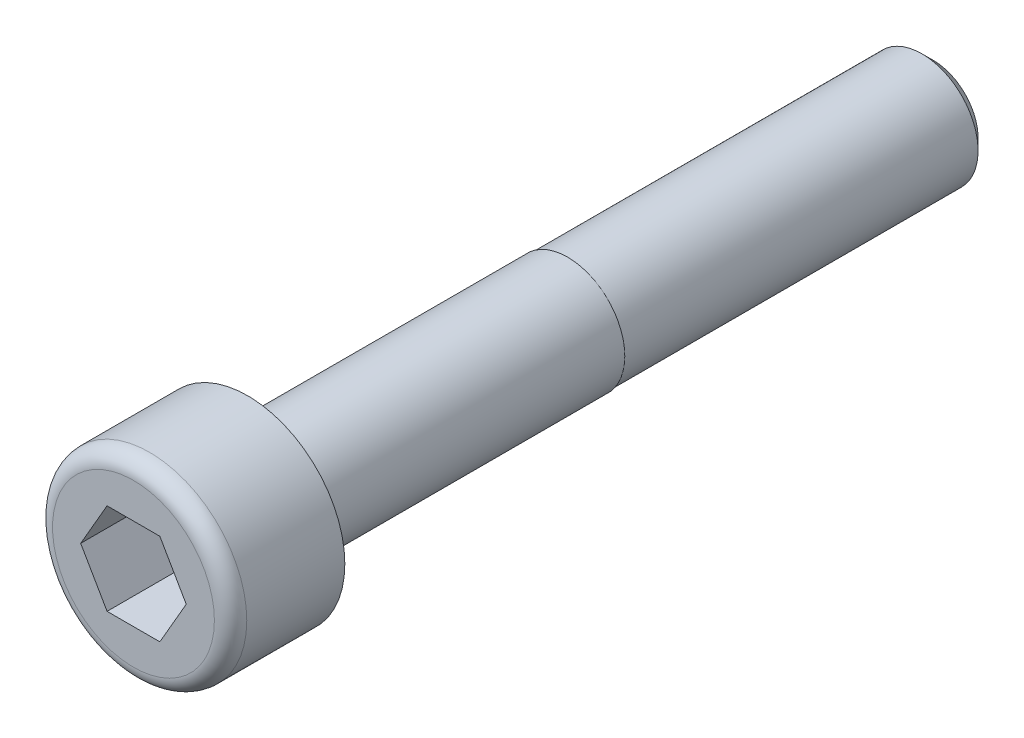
ISO-10303-21;
HEADER;
FILE_DESCRIPTION(('STEP AP214'),'2;1');
FILE_NAME('part.step','',(''),(''),'','','');
FILE_SCHEMA(('AUTOMOTIVE_DESIGN { 1 0 10303 214 1 1 1 1 }'));
ENDSEC;
DATA;
#1=APPLICATION_CONTEXT('core data for automotive mechanical design processes');
#2=APPLICATION_PROTOCOL_DEFINITION('international standard','automotive_design',2000,#1);
#3=PRODUCT_CONTEXT('',#1,'mechanical');
#4=PRODUCT('Part','Part','',(#3));
#5=PRODUCT_RELATED_PRODUCT_CATEGORY('part','',(#4));
#6=PRODUCT_DEFINITION_FORMATION('','',#4);
#7=PRODUCT_DEFINITION_CONTEXT('part definition',#1,'design');
#8=PRODUCT_DEFINITION('design','',#6,#7);
#9=PRODUCT_DEFINITION_SHAPE('','',#8);
#10=(LENGTH_UNIT() NAMED_UNIT(*) SI_UNIT(.MILLI.,.METRE.));
#11=(NAMED_UNIT(*) PLANE_ANGLE_UNIT() SI_UNIT($,.RADIAN.));
#12=(NAMED_UNIT(*) SI_UNIT($,.STERADIAN.) SOLID_ANGLE_UNIT());
#13=UNCERTAINTY_MEASURE_WITH_UNIT(LENGTH_MEASURE(1.E-05),#10,'distance_accuracy_value','');
#14=(GEOMETRIC_REPRESENTATION_CONTEXT(3) GLOBAL_UNCERTAINTY_ASSIGNED_CONTEXT((#13)) GLOBAL_UNIT_ASSIGNED_CONTEXT((#10,
#11,#12)) REPRESENTATION_CONTEXT('',''));
#15=CARTESIAN_POINT('',(0.,0.,0.));
#16=DIRECTION('',(0.,0.,1.));
#17=DIRECTION('',(1.,0.,0.));
#18=AXIS2_PLACEMENT_3D('',#15,#16,#17);
#19=CARTESIAN_POINT('',(0.,0.,-14.));
#20=DIRECTION('',(0.,0.,-1.));
#21=DIRECTION('',(-1.,0.,0.));
#22=AXIS2_PLACEMENT_3D('',#19,#20,#21);
#23=PLANE('',#22);
#24=CARTESIAN_POINT('',(0.,0.,-14.));
#25=DIRECTION('',(0.,0.,-1.));
#26=DIRECTION('',(-1.,0.,0.));
#27=AXIS2_PLACEMENT_3D('',#24,#25,#26);
#28=CIRCLE('',#27,2.5);
#29=CARTESIAN_POINT('',(-2.5,0.,-14.));
#30=VERTEX_POINT('',#29);
#31=EDGE_CURVE('E136',#30,#30,#28,.T.);
#32=ORIENTED_EDGE('',*,*,#31,.T.);
#33=EDGE_LOOP('',(#32));
#34=FACE_BOUND('',#33,.T.);
#35=CARTESIAN_POINT('',(0.,0.,-14.));
#36=DIRECTION('',(0.,0.,-1.));
#37=DIRECTION('',(-1.,0.,0.));
#38=AXIS2_PLACEMENT_3D('',#35,#36,#37);
#39=CIRCLE('',#38,2.45);
#40=CARTESIAN_POINT('',(-2.45,0.,-14.));
#41=VERTEX_POINT('',#40);
#42=EDGE_CURVE('E123',#41,#41,#39,.T.);
#43=ORIENTED_EDGE('',*,*,#42,.F.);
#44=EDGE_LOOP('',(#43));
#45=FACE_BOUND('',#44,.T.);
#46=ADVANCED_FACE('F33',(#34,#45),#23,.T.);
#47=CARTESIAN_POINT('',(0.,0.,0.));
#48=DIRECTION('',(0.,0.,1.));
#49=DIRECTION('',(1.,0.,0.));
#50=AXIS2_PLACEMENT_3D('',#47,#48,#49);
#51=PLANE('',#50);
#52=CARTESIAN_POINT('',(0.,0.,0.));
#53=DIRECTION('',(0.,0.,1.));
#54=DIRECTION('',(1.,0.,0.));
#55=AXIS2_PLACEMENT_3D('',#52,#53,#54);
#56=CIRCLE('',#55,4.25);
#57=CARTESIAN_POINT('',(4.25,0.,0.));
#58=VERTEX_POINT('',#57);
#59=EDGE_CURVE('E144',#58,#58,#56,.T.);
#60=ORIENTED_EDGE('',*,*,#59,.F.);
#61=EDGE_LOOP('',(#60));
#62=FACE_BOUND('',#61,.T.);
#63=CARTESIAN_POINT('',(0.,0.,0.));
#64=DIRECTION('',(0.,0.,1.));
#65=DIRECTION('',(1.,0.,0.));
#66=AXIS2_PLACEMENT_3D('',#63,#64,#65);
#67=CIRCLE('',#66,2.5);
#68=CARTESIAN_POINT('',(2.5,0.,0.));
#69=VERTEX_POINT('',#68);
#70=EDGE_CURVE('E147',#69,#69,#67,.F.);
#71=ORIENTED_EDGE('',*,*,#70,.F.);
#72=EDGE_LOOP('',(#71));
#73=FACE_BOUND('',#72,.T.);
#74=ADVANCED_FACE('F171',(#62,#73),#51,.F.);
#75=CARTESIAN_POINT('',(0.,0.,5.));
#76=DIRECTION('',(0.,0.,-1.));
#77=DIRECTION('',(-1.,0.,0.));
#78=AXIS2_PLACEMENT_3D('',#75,#76,#77);
#79=CYLINDRICAL_SURFACE('',#78,4.25);
#80=CARTESIAN_POINT('',(0.,0.,4.29166666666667));
#81=DIRECTION('',(0.,0.,1.));
#82=DIRECTION('',(1.,0.,0.));
#83=AXIS2_PLACEMENT_3D('',#80,#81,#82);
#84=CIRCLE('',#83,4.25);
#85=CARTESIAN_POINT('',(4.25,0.,4.29166666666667));
#86=VERTEX_POINT('',#85);
#87=EDGE_CURVE('E11',#86,#86,#84,.F.);
#88=ORIENTED_EDGE('',*,*,#87,.T.);
#89=EDGE_LOOP('',(#88));
#90=FACE_BOUND('',#89,.T.);
#91=ORIENTED_EDGE('',*,*,#59,.T.);
#92=EDGE_LOOP('',(#91));
#93=FACE_BOUND('',#92,.T.);
#94=ADVANCED_FACE('F177',(#90,#93),#79,.T.);
#95=CARTESIAN_POINT('',(0.,0.,5.));
#96=DIRECTION('',(0.,0.,1.));
#97=DIRECTION('',(1.,0.,0.));
#98=AXIS2_PLACEMENT_3D('',#95,#96,#97);
#99=PLANE('',#98);
#100=CARTESIAN_POINT('',(0.,0.,5.));
#101=DIRECTION('',(0.,0.,1.));
#102=DIRECTION('',(1.,0.,0.));
#103=AXIS2_PLACEMENT_3D('',#100,#101,#102);
#104=CIRCLE('',#103,3.54166666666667);
#105=CARTESIAN_POINT('',(3.54166666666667,0.,5.));
#106=VERTEX_POINT('',#105);
#107=EDGE_CURVE('E41',#106,#106,#104,.T.);
#108=ORIENTED_EDGE('',*,*,#107,.T.);
#109=EDGE_LOOP('',(#108));
#110=FACE_BOUND('',#109,.T.);
#111=DIRECTION('',(0.500000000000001,0.866025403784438,0.));
#112=VECTOR('',#111,1.);
#113=CARTESIAN_POINT('',(1.15470053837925,-2.,5.));
#114=LINE('',#113,#112);
#115=CARTESIAN_POINT('',(1.15470053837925,-2.,5.));
#116=VERTEX_POINT('',#115);
#117=CARTESIAN_POINT('',(2.3094010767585,0.,5.));
#118=VERTEX_POINT('',#117);
#119=EDGE_CURVE('E48',#116,#118,#114,.T.);
#120=ORIENTED_EDGE('',*,*,#119,.F.);
#121=DIRECTION('',(1.,0.,0.));
#122=VECTOR('',#121,1.);
#123=CARTESIAN_POINT('',(-1.15470053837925,-2.,5.));
#124=LINE('',#123,#122);
#125=CARTESIAN_POINT('',(-1.15470053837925,-2.,5.));
#126=VERTEX_POINT('',#125);
#127=EDGE_CURVE('E132',#126,#116,#124,.T.);
#128=ORIENTED_EDGE('',*,*,#127,.F.);
#129=DIRECTION('',(0.500000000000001,-0.866025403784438,0.));
#130=VECTOR('',#129,1.);
#131=CARTESIAN_POINT('',(-2.3094010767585,0.,5.));
#132=LINE('',#131,#130);
#133=CARTESIAN_POINT('',(-2.3094010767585,0.,5.));
#134=VERTEX_POINT('',#133);
#135=EDGE_CURVE('E130',#134,#126,#132,.T.);
#136=ORIENTED_EDGE('',*,*,#135,.F.);
#137=DIRECTION('',(-0.500000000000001,-0.866025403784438,0.));
#138=VECTOR('',#137,1.);
#139=CARTESIAN_POINT('',(-1.15470053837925,2.,5.));
#140=LINE('',#139,#138);
#141=CARTESIAN_POINT('',(-1.15470053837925,2.,5.));
#142=VERTEX_POINT('',#141);
#143=EDGE_CURVE('E96',#142,#134,#140,.T.);
#144=ORIENTED_EDGE('',*,*,#143,.F.);
#145=DIRECTION('',(-1.,0.,0.));
#146=VECTOR('',#145,1.);
#147=CARTESIAN_POINT('',(1.15470053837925,2.,5.));
#148=LINE('',#147,#146);
#149=CARTESIAN_POINT('',(1.15470053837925,2.,5.));
#150=VERTEX_POINT('',#149);
#151=EDGE_CURVE('E126',#150,#142,#148,.T.);
#152=ORIENTED_EDGE('',*,*,#151,.F.);
#153=DIRECTION('',(-0.500000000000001,0.866025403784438,0.));
#154=VECTOR('',#153,1.);
#155=CARTESIAN_POINT('',(2.3094010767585,0.,5.));
#156=LINE('',#155,#154);
#157=EDGE_CURVE('E122',#118,#150,#156,.T.);
#158=ORIENTED_EDGE('',*,*,#157,.F.);
#159=EDGE_LOOP('',(#120,#128,#136,#144,#152,#158));
#160=FACE_BOUND('',#159,.T.);
#161=ADVANCED_FACE('F158',(#110,#160),#99,.T.);
#162=CARTESIAN_POINT('',(0.,0.,-14.));
#163=DIRECTION('',(0.,0.,1.));
#164=DIRECTION('',(1.,0.,0.));
#165=AXIS2_PLACEMENT_3D('',#162,#163,#164);
#166=CYLINDRICAL_SURFACE('',#165,2.5);
#167=ORIENTED_EDGE('',*,*,#31,.F.);
#168=EDGE_LOOP('',(#167));
#169=FACE_BOUND('',#168,.T.);
#170=ORIENTED_EDGE('',*,*,#70,.T.);
#171=EDGE_LOOP('',(#170));
#172=FACE_BOUND('',#171,.T.);
#173=ADVANCED_FACE('F185',(#169,#172),#166,.T.);
#174=CARTESIAN_POINT('',(1.15470053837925,-2.,0.));
#175=DIRECTION('',(0.866025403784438,-0.500000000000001,0.));
#176=DIRECTION('',(0.500000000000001,0.866025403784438,0.));
#177=AXIS2_PLACEMENT_3D('',#174,#175,#176);
#178=PLANE('',#177);
#179=ORIENTED_EDGE('',*,*,#119,.T.);
#180=DIRECTION('',(0.,0.,1.));
#181=VECTOR('',#180,1.);
#182=CARTESIAN_POINT('',(2.3094010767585,0.,0.));
#183=LINE('',#182,#181);
#184=CARTESIAN_POINT('',(2.3094010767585,0.,0.));
#185=VERTEX_POINT('',#184);
#186=EDGE_CURVE('E78',#185,#118,#183,.T.);
#187=ORIENTED_EDGE('',*,*,#186,.F.);
#188=DIRECTION('',(0.500000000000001,0.866025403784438,0.));
#189=VECTOR('',#188,1.);
#190=CARTESIAN_POINT('',(1.15470053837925,-2.,0.));
#191=LINE('',#190,#189);
#192=CARTESIAN_POINT('',(1.15470053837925,-2.,0.));
#193=VERTEX_POINT('',#192);
#194=EDGE_CURVE('E134',#193,#185,#191,.T.);
#195=ORIENTED_EDGE('',*,*,#194,.F.);
#196=DIRECTION('',(0.,0.,1.));
#197=VECTOR('',#196,1.);
#198=CARTESIAN_POINT('',(1.15470053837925,-2.,0.));
#199=LINE('',#198,#197);
#200=EDGE_CURVE('E56',#193,#116,#199,.T.);
#201=ORIENTED_EDGE('',*,*,#200,.T.);
#202=EDGE_LOOP('',(#179,#187,#195,#201));
#203=FACE_BOUND('',#202,.T.);
#204=ADVANCED_FACE('F183',(#203),#178,.F.);
#205=CARTESIAN_POINT('',(-1.15470053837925,-2.,0.));
#206=DIRECTION('',(0.,-1.,0.));
#207=DIRECTION('',(0.,0.,-1.));
#208=AXIS2_PLACEMENT_3D('',#205,#206,#207);
#209=PLANE('',#208);
#210=ORIENTED_EDGE('',*,*,#127,.T.);
#211=ORIENTED_EDGE('',*,*,#200,.F.);
#212=DIRECTION('',(1.,0.,0.));
#213=VECTOR('',#212,1.);
#214=CARTESIAN_POINT('',(-1.15470053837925,-2.,0.));
#215=LINE('',#214,#213);
#216=CARTESIAN_POINT('',(-1.15470053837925,-2.,0.));
#217=VERTEX_POINT('',#216);
#218=EDGE_CURVE('E108',#217,#193,#215,.T.);
#219=ORIENTED_EDGE('',*,*,#218,.F.);
#220=DIRECTION('',(0.,0.,1.));
#221=VECTOR('',#220,1.);
#222=CARTESIAN_POINT('',(-1.15470053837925,-2.,0.));
#223=LINE('',#222,#221);
#224=EDGE_CURVE('E100',#217,#126,#223,.T.);
#225=ORIENTED_EDGE('',*,*,#224,.T.);
#226=EDGE_LOOP('',(#210,#211,#219,#225));
#227=FACE_BOUND('',#226,.T.);
#228=ADVANCED_FACE('F217',(#227),#209,.F.);
#229=CARTESIAN_POINT('',(-2.3094010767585,0.,0.));
#230=DIRECTION('',(-0.866025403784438,-0.500000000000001,0.));
#231=DIRECTION('',(0.500000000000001,-0.866025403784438,0.));
#232=AXIS2_PLACEMENT_3D('',#229,#230,#231);
#233=PLANE('',#232);
#234=ORIENTED_EDGE('',*,*,#135,.T.);
#235=ORIENTED_EDGE('',*,*,#224,.F.);
#236=DIRECTION('',(0.500000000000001,-0.866025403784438,0.));
#237=VECTOR('',#236,1.);
#238=CARTESIAN_POINT('',(-2.3094010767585,0.,0.));
#239=LINE('',#238,#237);
#240=CARTESIAN_POINT('',(-2.3094010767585,0.,0.));
#241=VERTEX_POINT('',#240);
#242=EDGE_CURVE('E104',#241,#217,#239,.T.);
#243=ORIENTED_EDGE('',*,*,#242,.F.);
#244=DIRECTION('',(0.,0.,1.));
#245=VECTOR('',#244,1.);
#246=CARTESIAN_POINT('',(-2.3094010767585,0.,0.));
#247=LINE('',#246,#245);
#248=EDGE_CURVE('E89',#241,#134,#247,.T.);
#249=ORIENTED_EDGE('',*,*,#248,.T.);
#250=EDGE_LOOP('',(#234,#235,#243,#249));
#251=FACE_BOUND('',#250,.T.);
#252=ADVANCED_FACE('F105',(#251),#233,.F.);
#253=CARTESIAN_POINT('',(-1.15470053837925,2.,0.));
#254=DIRECTION('',(-0.866025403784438,0.500000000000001,0.));
#255=DIRECTION('',(-0.500000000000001,-0.866025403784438,0.));
#256=AXIS2_PLACEMENT_3D('',#253,#254,#255);
#257=PLANE('',#256);
#258=ORIENTED_EDGE('',*,*,#143,.T.);
#259=ORIENTED_EDGE('',*,*,#248,.F.);
#260=DIRECTION('',(-0.500000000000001,-0.866025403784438,0.));
#261=VECTOR('',#260,1.);
#262=CARTESIAN_POINT('',(-1.15470053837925,2.,0.));
#263=LINE('',#262,#261);
#264=CARTESIAN_POINT('',(-1.15470053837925,2.,0.));
#265=VERTEX_POINT('',#264);
#266=EDGE_CURVE('E93',#265,#241,#263,.T.);
#267=ORIENTED_EDGE('',*,*,#266,.F.);
#268=DIRECTION('',(0.,0.,1.));
#269=VECTOR('',#268,1.);
#270=CARTESIAN_POINT('',(-1.15470053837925,2.,0.));
#271=LINE('',#270,#269);
#272=EDGE_CURVE('E101',#265,#142,#271,.T.);
#273=ORIENTED_EDGE('',*,*,#272,.T.);
#274=EDGE_LOOP('',(#258,#259,#267,#273));
#275=FACE_BOUND('',#274,.T.);
#276=ADVANCED_FACE('F91',(#275),#257,.F.);
#277=CARTESIAN_POINT('',(1.15470053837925,2.,0.));
#278=DIRECTION('',(0.,1.,0.));
#279=DIRECTION('',(-1.,0.,0.));
#280=AXIS2_PLACEMENT_3D('',#277,#278,#279);
#281=PLANE('',#280);
#282=ORIENTED_EDGE('',*,*,#151,.T.);
#283=ORIENTED_EDGE('',*,*,#272,.F.);
#284=DIRECTION('',(-1.,0.,0.));
#285=VECTOR('',#284,1.);
#286=CARTESIAN_POINT('',(1.15470053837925,2.,0.));
#287=LINE('',#286,#285);
#288=CARTESIAN_POINT('',(1.15470053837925,2.,0.));
#289=VERTEX_POINT('',#288);
#290=EDGE_CURVE('E114',#289,#265,#287,.T.);
#291=ORIENTED_EDGE('',*,*,#290,.F.);
#292=DIRECTION('',(0.,0.,1.));
#293=VECTOR('',#292,1.);
#294=CARTESIAN_POINT('',(1.15470053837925,2.,0.));
#295=LINE('',#294,#293);
#296=EDGE_CURVE('E139',#289,#150,#295,.T.);
#297=ORIENTED_EDGE('',*,*,#296,.T.);
#298=EDGE_LOOP('',(#282,#283,#291,#297));
#299=FACE_BOUND('',#298,.T.);
#300=ADVANCED_FACE('F235',(#299),#281,.F.);
#301=CARTESIAN_POINT('',(2.3094010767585,0.,0.));
#302=DIRECTION('',(0.866025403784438,0.500000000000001,0.));
#303=DIRECTION('',(-0.500000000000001,0.866025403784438,0.));
#304=AXIS2_PLACEMENT_3D('',#301,#302,#303);
#305=PLANE('',#304);
#306=ORIENTED_EDGE('',*,*,#157,.T.);
#307=ORIENTED_EDGE('',*,*,#296,.F.);
#308=DIRECTION('',(-0.500000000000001,0.866025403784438,0.));
#309=VECTOR('',#308,1.);
#310=CARTESIAN_POINT('',(2.3094010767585,0.,0.));
#311=LINE('',#310,#309);
#312=EDGE_CURVE('E116',#185,#289,#311,.T.);
#313=ORIENTED_EDGE('',*,*,#312,.F.);
#314=ORIENTED_EDGE('',*,*,#186,.T.);
#315=EDGE_LOOP('',(#306,#307,#313,#314));
#316=FACE_BOUND('',#315,.T.);
#317=ADVANCED_FACE('F242',(#316),#305,.F.);
#318=CARTESIAN_POINT('',(2.3094010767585,0.,0.));
#319=DIRECTION('',(0.,0.,1.));
#320=DIRECTION('',(1.,0.,0.));
#321=AXIS2_PLACEMENT_3D('',#318,#319,#320);
#322=PLANE('',#321);
#323=ORIENTED_EDGE('',*,*,#194,.T.);
#324=ORIENTED_EDGE('',*,*,#312,.T.);
#325=ORIENTED_EDGE('',*,*,#290,.T.);
#326=ORIENTED_EDGE('',*,*,#266,.T.);
#327=ORIENTED_EDGE('',*,*,#242,.T.);
#328=ORIENTED_EDGE('',*,*,#218,.T.);
#329=EDGE_LOOP('',(#323,#324,#325,#326,#327,#328));
#330=FACE_BOUND('',#329,.T.);
#331=ADVANCED_FACE('F111',(#330),#322,.T.);
#332=CARTESIAN_POINT('',(0.,0.,-30.));
#333=DIRECTION('',(0.,0.,1.));
#334=DIRECTION('',(1.,0.,0.));
#335=AXIS2_PLACEMENT_3D('',#332,#333,#334);
#336=CYLINDRICAL_SURFACE('',#335,2.45);
#337=CARTESIAN_POINT('',(0.,0.,-29.51));
#338=DIRECTION('',(0.,0.,-1.));
#339=DIRECTION('',(-1.,0.,0.));
#340=AXIS2_PLACEMENT_3D('',#337,#338,#339);
#341=CIRCLE('',#340,2.45);
#342=CARTESIAN_POINT('',(-2.45,0.,-29.51));
#343=VERTEX_POINT('',#342);
#344=EDGE_CURVE('E153',#343,#343,#341,.F.);
#345=ORIENTED_EDGE('',*,*,#344,.T.);
#346=EDGE_LOOP('',(#345));
#347=FACE_BOUND('',#346,.T.);
#348=ORIENTED_EDGE('',*,*,#42,.T.);
#349=EDGE_LOOP('',(#348));
#350=FACE_BOUND('',#349,.T.);
#351=ADVANCED_FACE('F256',(#347,#350),#336,.T.);
#352=CARTESIAN_POINT('',(0.,0.,-30.));
#353=DIRECTION('',(0.,0.,-1.));
#354=DIRECTION('',(-1.,0.,0.));
#355=AXIS2_PLACEMENT_3D('',#352,#353,#354);
#356=PLANE('',#355);
#357=CARTESIAN_POINT('',(0.,0.,-30.));
#358=DIRECTION('',(0.,0.,-1.));
#359=DIRECTION('',(-1.,0.,0.));
#360=AXIS2_PLACEMENT_3D('',#357,#358,#359);
#361=CIRCLE('',#360,1.95999999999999);
#362=CARTESIAN_POINT('',(-1.95999999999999,0.,-30.));
#363=VERTEX_POINT('',#362);
#364=EDGE_CURVE('E150',#363,#363,#361,.T.);
#365=ORIENTED_EDGE('',*,*,#364,.T.);
#366=EDGE_LOOP('',(#365));
#367=FACE_BOUND('',#366,.T.);
#368=ADVANCED_FACE('F167',(#367),#356,.T.);
#369=CARTESIAN_POINT('',(0.,0.,-30.));
#370=DIRECTION('',(0.,0.,1.));
#371=DIRECTION('',(1.,0.,0.));
#372=AXIS2_PLACEMENT_3D('',#369,#370,#371);
#373=CONICAL_SURFACE('',#372,1.95999999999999,0.785398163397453);
#374=ORIENTED_EDGE('',*,*,#344,.F.);
#375=EDGE_LOOP('',(#374));
#376=FACE_BOUND('',#375,.T.);
#377=ORIENTED_EDGE('',*,*,#364,.F.);
#378=EDGE_LOOP('',(#377));
#379=FACE_BOUND('',#378,.T.);
#380=ADVANCED_FACE('F162',(#376,#379),#373,.T.);
#381=CARTESIAN_POINT('',(0.,0.,4.29166666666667));
#382=DIRECTION('',(0.,0.,1.));
#383=DIRECTION('',(1.,0.,0.));
#384=AXIS2_PLACEMENT_3D('',#381,#382,#383);
#385=TOROIDAL_SURFACE('',#384,3.54166666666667,0.708333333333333);
#386=ORIENTED_EDGE('',*,*,#87,.F.);
#387=EDGE_LOOP('',(#386));
#388=FACE_BOUND('',#387,.T.);
#389=ORIENTED_EDGE('',*,*,#107,.F.);
#390=EDGE_LOOP('',(#389));
#391=FACE_BOUND('',#390,.T.);
#392=ADVANCED_FACE('F35',(#388,#391),#385,.T.);
#393=CLOSED_SHELL('',(#46,#74,#94,#161,#173,#204,#228,#252,#276,#300,#317,#331,#351,#368,#380,#392));
#394=MANIFOLD_SOLID_BREP('B2',#393);
#395=ADVANCED_BREP_SHAPE_REPRESENTATION('',(#18,#394),#14);
#396=SHAPE_DEFINITION_REPRESENTATION(#9,#395);
ENDSEC;
END-ISO-10303-21;
